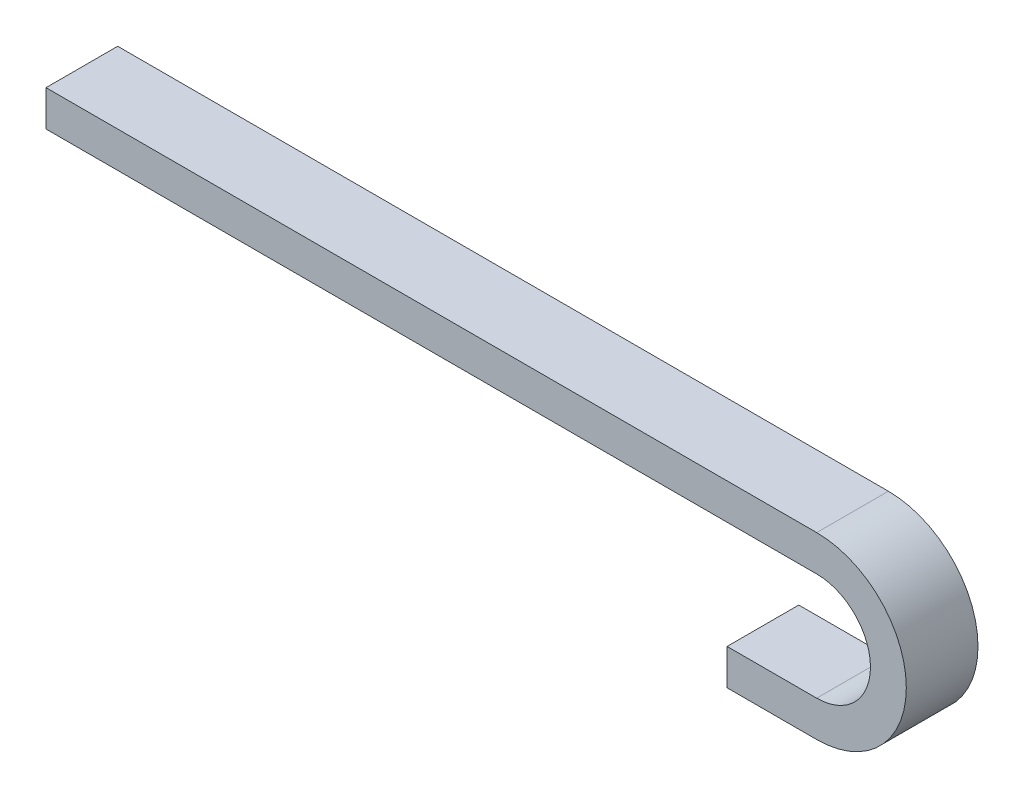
from build123d import *

# Parameters (mm, degrees)
LINEAR_AUSTRAGEN_D_NN1_DEPTH = 50


with BuildPart() as part:
    # Skizze1 → Linear-Austragen-D_nn1 (new, symmetric)
    with BuildSketch(Plane.XY):
        with BuildLine():
            Line((0, -25), (125, -25))
            ThreePointArc((125, -25), (250, 100), (125, 225))
            Line((125, 225), (-950, 225))
            Line((-950, 225), (-950, 175))
            Line((-950, 175), (125, 175))
            ThreePointArc((125, 175), (200, 100), (125, 25))
            Line((125, 25), (0, 25))
            Line((0, 25), (0, -25))
        make_face()
    extrude(amount=LINEAR_AUSTRAGEN_D_NN1_DEPTH, both=True)


solid = part.part
